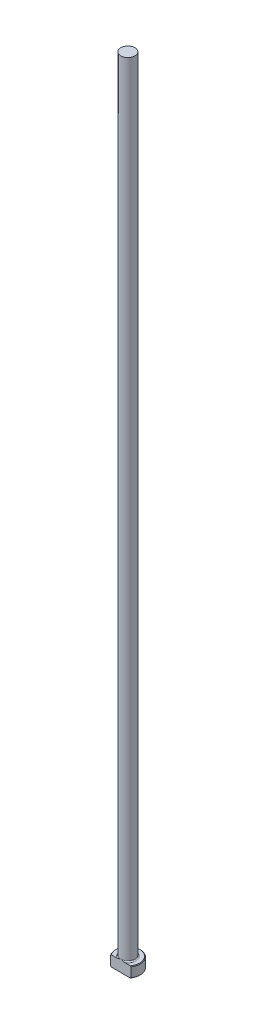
from build123d import *

# Parameters (mm, degrees)
CHAMFER1_SIZE = 0.254
FILLET1_R     = 0.508
KEY_DEPTH     = 356.686607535


with BuildPart() as part:
    # Sketch1 → Revolve1 (revolve)
    with BuildSketch(Plane.XY, mode=Mode.PRIVATE) as revolve1_sk:
        Polygon((0, 0), (-5.5499, 0), (-5.5499, 4.7498), (-3.175, 4.7498), (-3.175, 355.6), (0, 355.6), align=None)
    revolve(revolve1_sk.sketch.rotate(Axis((0, 259.958771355, 0), (0, -1, 0)), 270), axis=Axis((0, 259.958771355, 0), (0, -1, 0)))

    # Chamfer1
    chamfer1_edges = [part.edges().sort_by_distance(p)[0] for p in [
        (0, 4.7498, -5.5499),
        (0, 0, -5.5499),
    ]]
    chamfer(chamfer1_edges, length=CHAMFER1_SIZE)

    # Fillet1
    fillet1_edges = [part.edges().sort_by_distance(p)[0] for p in [
        (0, 4.7498, -3.175),
    ]]
    fillet(fillet1_edges, radius=FILLET1_R)

    # Sketch2 → KEY (cut, through all)
    with BuildSketch(Plane.XZ):
        with BuildLine():
            Line((-4.552006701, 3.175), (4.552006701, 3.175))
            ThreePointArc((4.552006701, 3.175), (0, 5.5499), (-4.552006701, 3.175))
        make_face()
    extrude(amount=-KEY_DEPTH, mode=Mode.SUBTRACT)


solid = part.part
